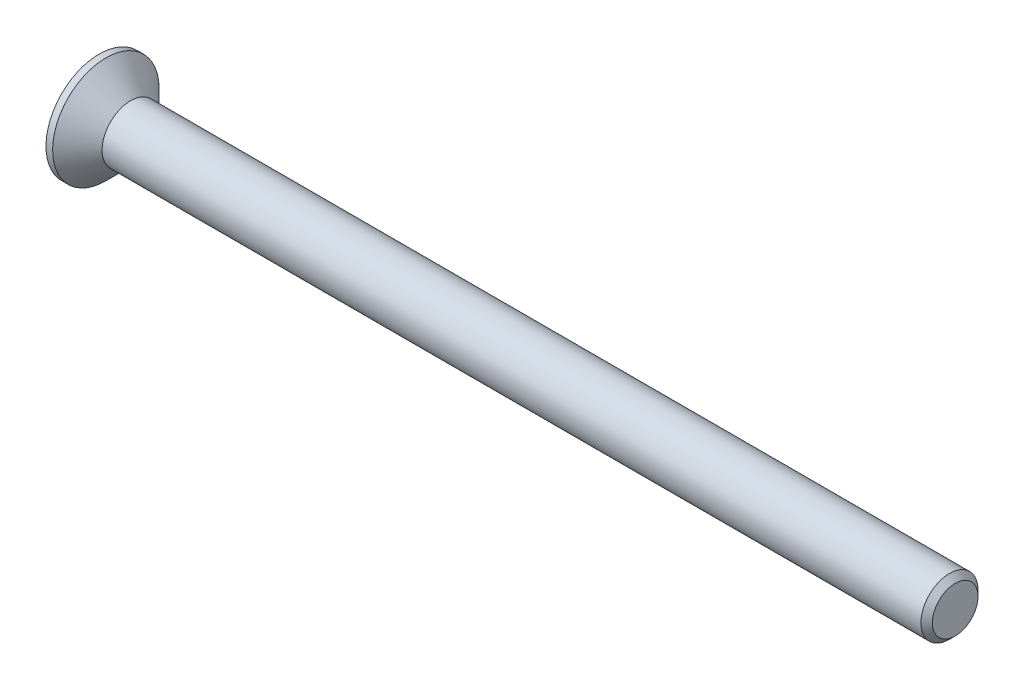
ISO-10303-21;
HEADER;
FILE_DESCRIPTION(('STEP AP214'),'2;1');
FILE_NAME('part.step','',(''),(''),'','','');
FILE_SCHEMA(('AUTOMOTIVE_DESIGN { 1 0 10303 214 1 1 1 1 }'));
ENDSEC;
DATA;
#1=APPLICATION_CONTEXT('core data for automotive mechanical design processes');
#2=APPLICATION_PROTOCOL_DEFINITION('international standard','automotive_design',2000,#1);
#3=PRODUCT_CONTEXT('',#1,'mechanical');
#4=PRODUCT('Part','Part','',(#3));
#5=PRODUCT_RELATED_PRODUCT_CATEGORY('part','',(#4));
#6=PRODUCT_DEFINITION_FORMATION('','',#4);
#7=PRODUCT_DEFINITION_CONTEXT('part definition',#1,'design');
#8=PRODUCT_DEFINITION('design','',#6,#7);
#9=PRODUCT_DEFINITION_SHAPE('','',#8);
#10=(LENGTH_UNIT() NAMED_UNIT(*) SI_UNIT(.MILLI.,.METRE.));
#11=(NAMED_UNIT(*) PLANE_ANGLE_UNIT() SI_UNIT($,.RADIAN.));
#12=(NAMED_UNIT(*) SI_UNIT($,.STERADIAN.) SOLID_ANGLE_UNIT());
#13=UNCERTAINTY_MEASURE_WITH_UNIT(LENGTH_MEASURE(1.E-05),#10,'distance_accuracy_value','');
#14=(GEOMETRIC_REPRESENTATION_CONTEXT(3) GLOBAL_UNCERTAINTY_ASSIGNED_CONTEXT((#13)) GLOBAL_UNIT_ASSIGNED_CONTEXT((#10,
#11,#12)) REPRESENTATION_CONTEXT('',''));
#15=CARTESIAN_POINT('',(0.,0.,0.));
#16=DIRECTION('',(0.,0.,1.));
#17=DIRECTION('',(1.,0.,0.));
#18=AXIS2_PLACEMENT_3D('',#15,#16,#17);
#19=CARTESIAN_POINT('',(0.,0.,0.));
#20=DIRECTION('',(-1.,0.,0.));
#21=DIRECTION('',(0.,-1.,0.));
#22=AXIS2_PLACEMENT_3D('',#19,#20,#21);
#23=CONICAL_SURFACE('',#22,1.5,0.78539816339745);
#24=CARTESIAN_POINT('',(-1.3,0.,0.));
#25=DIRECTION('',(-1.,0.,0.));
#26=DIRECTION('',(0.,-1.,0.));
#27=AXIS2_PLACEMENT_3D('',#24,#25,#26);
#28=CIRCLE('',#27,2.8);
#29=CARTESIAN_POINT('',(-1.3,-2.8,0.));
#30=VERTEX_POINT('',#29);
#31=EDGE_CURVE('E189',#30,#30,#28,.T.);
#32=ORIENTED_EDGE('',*,*,#31,.F.);
#33=EDGE_LOOP('',(#32));
#34=FACE_BOUND('',#33,.T.);
#35=CARTESIAN_POINT('',(0.,0.,0.));
#36=DIRECTION('',(-1.,0.,0.));
#37=DIRECTION('',(0.,-1.,0.));
#38=AXIS2_PLACEMENT_3D('',#35,#36,#37);
#39=CIRCLE('',#38,1.5);
#40=CARTESIAN_POINT('',(0.,-1.5,0.));
#41=VERTEX_POINT('',#40);
#42=EDGE_CURVE('E212',#41,#41,#39,.T.);
#43=ORIENTED_EDGE('',*,*,#42,.T.);
#44=EDGE_LOOP('',(#43));
#45=FACE_BOUND('',#44,.T.);
#46=ADVANCED_FACE('F33',(#34,#45),#23,.T.);
#47=CARTESIAN_POINT('',(-1.65,0.,0.));
#48=DIRECTION('',(-1.,0.,0.));
#49=DIRECTION('',(0.,-1.,0.));
#50=AXIS2_PLACEMENT_3D('',#47,#48,#49);
#51=CYLINDRICAL_SURFACE('',#50,1.5);
#52=CARTESIAN_POINT('',(43.05,0.,0.));
#53=DIRECTION('',(-1.,0.,0.));
#54=DIRECTION('',(0.,-1.,0.));
#55=AXIS2_PLACEMENT_3D('',#52,#53,#54);
#56=CIRCLE('',#55,1.5);
#57=CARTESIAN_POINT('',(43.05,-1.5,0.));
#58=VERTEX_POINT('',#57);
#59=EDGE_CURVE('E41',#58,#58,#56,.T.);
#60=ORIENTED_EDGE('',*,*,#59,.T.);
#61=EDGE_LOOP('',(#60));
#62=FACE_BOUND('',#61,.T.);
#63=ORIENTED_EDGE('',*,*,#42,.F.);
#64=EDGE_LOOP('',(#63));
#65=FACE_BOUND('',#64,.T.);
#66=ADVANCED_FACE('F217',(#62,#65),#51,.T.);
#67=CARTESIAN_POINT('',(43.35,0.,0.));
#68=DIRECTION('',(-1.,0.,0.));
#69=DIRECTION('',(0.,-1.,0.));
#70=AXIS2_PLACEMENT_3D('',#67,#68,#69);
#71=PLANE('',#70);
#72=CARTESIAN_POINT('',(43.35,0.,0.));
#73=DIRECTION('',(-1.,0.,0.));
#74=DIRECTION('',(0.,-1.,0.));
#75=AXIS2_PLACEMENT_3D('',#72,#73,#74);
#76=CIRCLE('',#75,1.19999999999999);
#77=CARTESIAN_POINT('',(43.35,-1.19999999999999,0.));
#78=VERTEX_POINT('',#77);
#79=EDGE_CURVE('E11',#78,#78,#76,.F.);
#80=ORIENTED_EDGE('',*,*,#79,.T.);
#81=EDGE_LOOP('',(#80));
#82=FACE_BOUND('',#81,.T.);
#83=ADVANCED_FACE('F239',(#82),#71,.F.);
#84=CARTESIAN_POINT('',(-1.65,2.8,0.));
#85=DIRECTION('',(1.,0.,0.));
#86=DIRECTION('',(0.,1.,0.));
#87=AXIS2_PLACEMENT_3D('',#84,#85,#86);
#88=PLANE('',#87);
#89=DIRECTION('',(0.,0.,-1.));
#90=VECTOR('',#89,1.);
#91=CARTESIAN_POINT('',(-1.65,0.365,-1.45));
#92=LINE('',#91,#90);
#93=CARTESIAN_POINT('',(-1.65,0.365,-0.365));
#94=VERTEX_POINT('',#93);
#95=CARTESIAN_POINT('',(-1.65,0.365,-1.45));
#96=VERTEX_POINT('',#95);
#97=EDGE_CURVE('E158',#94,#96,#92,.T.);
#98=ORIENTED_EDGE('',*,*,#97,.F.);
#99=DIRECTION('',(0.,-1.,0.));
#100=VECTOR('',#99,1.);
#101=CARTESIAN_POINT('',(-1.65,0.365,-0.365));
#102=LINE('',#101,#100);
#103=CARTESIAN_POINT('',(-1.65,1.45,-0.365));
#104=VERTEX_POINT('',#103);
#105=EDGE_CURVE('E48',#104,#94,#102,.T.);
#106=ORIENTED_EDGE('',*,*,#105,.F.);
#107=DIRECTION('',(0.,0.,-1.));
#108=VECTOR('',#107,1.);
#109=CARTESIAN_POINT('',(-1.65,1.45,-0.365));
#110=LINE('',#109,#108);
#111=CARTESIAN_POINT('',(-1.65,1.45,0.365));
#112=VERTEX_POINT('',#111);
#113=EDGE_CURVE('E185',#112,#104,#110,.T.);
#114=ORIENTED_EDGE('',*,*,#113,.F.);
#115=DIRECTION('',(0.,1.,0.));
#116=VECTOR('',#115,1.);
#117=CARTESIAN_POINT('',(-1.65,1.45,0.365));
#118=LINE('',#117,#116);
#119=CARTESIAN_POINT('',(-1.65,0.365,0.365));
#120=VERTEX_POINT('',#119);
#121=EDGE_CURVE('E183',#120,#112,#118,.T.);
#122=ORIENTED_EDGE('',*,*,#121,.F.);
#123=DIRECTION('',(0.,0.,-1.));
#124=VECTOR('',#123,1.);
#125=CARTESIAN_POINT('',(-1.65,0.365,0.365));
#126=LINE('',#125,#124);
#127=CARTESIAN_POINT('',(-1.65,0.365,1.45));
#128=VERTEX_POINT('',#127);
#129=EDGE_CURVE('E132',#128,#120,#126,.T.);
#130=ORIENTED_EDGE('',*,*,#129,.F.);
#131=DIRECTION('',(0.,1.,0.));
#132=VECTOR('',#131,1.);
#133=CARTESIAN_POINT('',(-1.65,0.365,1.45));
#134=LINE('',#133,#132);
#135=CARTESIAN_POINT('',(-1.65,-0.365,1.45));
#136=VERTEX_POINT('',#135);
#137=EDGE_CURVE('E179',#136,#128,#134,.T.);
#138=ORIENTED_EDGE('',*,*,#137,.F.);
#139=DIRECTION('',(0.,0.,1.));
#140=VECTOR('',#139,1.);
#141=CARTESIAN_POINT('',(-1.65,-0.365,1.45));
#142=LINE('',#141,#140);
#143=CARTESIAN_POINT('',(-1.65,-0.365,0.365));
#144=VERTEX_POINT('',#143);
#145=EDGE_CURVE('E176',#144,#136,#142,.T.);
#146=ORIENTED_EDGE('',*,*,#145,.F.);
#147=DIRECTION('',(0.,1.,0.));
#148=VECTOR('',#147,1.);
#149=CARTESIAN_POINT('',(-1.65,-0.365,0.365));
#150=LINE('',#149,#148);
#151=CARTESIAN_POINT('',(-1.65,-1.45,0.365));
#152=VERTEX_POINT('',#151);
#153=EDGE_CURVE('E173',#152,#144,#150,.T.);
#154=ORIENTED_EDGE('',*,*,#153,.F.);
#155=DIRECTION('',(0.,0.,1.));
#156=VECTOR('',#155,1.);
#157=CARTESIAN_POINT('',(-1.65,-1.45,0.365));
#158=LINE('',#157,#156);
#159=CARTESIAN_POINT('',(-1.65,-1.45,-0.365));
#160=VERTEX_POINT('',#159);
#161=EDGE_CURVE('E170',#160,#152,#158,.T.);
#162=ORIENTED_EDGE('',*,*,#161,.F.);
#163=DIRECTION('',(0.,-1.,0.));
#164=VECTOR('',#163,1.);
#165=CARTESIAN_POINT('',(-1.65,-1.45,-0.365));
#166=LINE('',#165,#164);
#167=CARTESIAN_POINT('',(-1.65,-0.365,-0.365));
#168=VERTEX_POINT('',#167);
#169=EDGE_CURVE('E167',#168,#160,#166,.T.);
#170=ORIENTED_EDGE('',*,*,#169,.F.);
#171=DIRECTION('',(0.,0.,1.));
#172=VECTOR('',#171,1.);
#173=CARTESIAN_POINT('',(-1.65,-0.365,-0.365));
#174=LINE('',#173,#172);
#175=CARTESIAN_POINT('',(-1.65,-0.365,-1.45));
#176=VERTEX_POINT('',#175);
#177=EDGE_CURVE('E164',#176,#168,#174,.T.);
#178=ORIENTED_EDGE('',*,*,#177,.F.);
#179=DIRECTION('',(0.,-1.,0.));
#180=VECTOR('',#179,1.);
#181=CARTESIAN_POINT('',(-1.65,-0.365,-1.45));
#182=LINE('',#181,#180);
#183=EDGE_CURVE('E161',#96,#176,#182,.T.);
#184=ORIENTED_EDGE('',*,*,#183,.F.);
#185=EDGE_LOOP('',(#98,#106,#114,#122,#130,#138,#146,#154,#162,#170,#178,#184));
#186=FACE_BOUND('',#185,.T.);
#187=CARTESIAN_POINT('',(-1.65,0.,0.));
#188=DIRECTION('',(-1.,0.,0.));
#189=DIRECTION('',(0.,-1.,0.));
#190=AXIS2_PLACEMENT_3D('',#187,#188,#189);
#191=CIRCLE('',#190,2.8);
#192=CARTESIAN_POINT('',(-1.65,-2.8,0.));
#193=VERTEX_POINT('',#192);
#194=EDGE_CURVE('E209',#193,#193,#191,.T.);
#195=ORIENTED_EDGE('',*,*,#194,.T.);
#196=EDGE_LOOP('',(#195));
#197=FACE_BOUND('',#196,.T.);
#198=ADVANCED_FACE('F230',(#186,#197),#88,.F.);
#199=CARTESIAN_POINT('',(-1.65,0.,0.));
#200=DIRECTION('',(-1.,0.,0.));
#201=DIRECTION('',(0.,-1.,0.));
#202=AXIS2_PLACEMENT_3D('',#199,#200,#201);
#203=CYLINDRICAL_SURFACE('',#202,2.8);
#204=ORIENTED_EDGE('',*,*,#194,.F.);
#205=EDGE_LOOP('',(#204));
#206=FACE_BOUND('',#205,.T.);
#207=ORIENTED_EDGE('',*,*,#31,.T.);
#208=EDGE_LOOP('',(#207));
#209=FACE_BOUND('',#208,.T.);
#210=ADVANCED_FACE('F222',(#206,#209),#203,.T.);
#211=CARTESIAN_POINT('',(43.05,0.,0.));
#212=DIRECTION('',(-1.,0.,0.));
#213=DIRECTION('',(0.,-1.,0.));
#214=AXIS2_PLACEMENT_3D('',#211,#212,#213);
#215=CONICAL_SURFACE('',#214,1.5,0.78539816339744);
#216=ORIENTED_EDGE('',*,*,#79,.F.);
#217=EDGE_LOOP('',(#216));
#218=FACE_BOUND('',#217,.T.);
#219=ORIENTED_EDGE('',*,*,#59,.F.);
#220=EDGE_LOOP('',(#219));
#221=FACE_BOUND('',#220,.T.);
#222=ADVANCED_FACE('F35',(#218,#221),#215,.T.);
#223=CARTESIAN_POINT('',(-0.4,0.365,-0.365));
#224=DIRECTION('',(0.,0.,-1.));
#225=DIRECTION('',(-1.,0.,0.));
#226=AXIS2_PLACEMENT_3D('',#223,#224,#225);
#227=PLANE('',#226);
#228=ORIENTED_EDGE('',*,*,#105,.T.);
#229=DIRECTION('',(-1.,0.,0.));
#230=VECTOR('',#229,1.);
#231=CARTESIAN_POINT('',(-0.4,0.365,-0.365));
#232=LINE('',#231,#230);
#233=CARTESIAN_POINT('',(-0.4,0.365,-0.365));
#234=VERTEX_POINT('',#233);
#235=EDGE_CURVE('E96',#234,#94,#232,.T.);
#236=ORIENTED_EDGE('',*,*,#235,.F.);
#237=DIRECTION('',(0.,-1.,0.));
#238=VECTOR('',#237,1.);
#239=CARTESIAN_POINT('',(-0.4,0.365,-0.365));
#240=LINE('',#239,#238);
#241=CARTESIAN_POINT('',(-0.4,1.45,-0.365));
#242=VERTEX_POINT('',#241);
#243=EDGE_CURVE('E187',#242,#234,#240,.T.);
#244=ORIENTED_EDGE('',*,*,#243,.F.);
#245=DIRECTION('',(-1.,0.,0.));
#246=VECTOR('',#245,1.);
#247=CARTESIAN_POINT('',(-0.4,1.45,-0.365));
#248=LINE('',#247,#246);
#249=EDGE_CURVE('E56',#242,#104,#248,.T.);
#250=ORIENTED_EDGE('',*,*,#249,.T.);
#251=EDGE_LOOP('',(#228,#236,#244,#250));
#252=FACE_BOUND('',#251,.T.);
#253=ADVANCED_FACE('F221',(#252),#227,.F.);
#254=CARTESIAN_POINT('',(-0.4,1.45,-0.365));
#255=DIRECTION('',(0.,1.,0.));
#256=DIRECTION('',(-1.,0.,0.));
#257=AXIS2_PLACEMENT_3D('',#254,#255,#256);
#258=PLANE('',#257);
#259=ORIENTED_EDGE('',*,*,#113,.T.);
#260=ORIENTED_EDGE('',*,*,#249,.F.);
#261=DIRECTION('',(0.,0.,-1.));
#262=VECTOR('',#261,1.);
#263=CARTESIAN_POINT('',(-0.4,1.45,-0.365));
#264=LINE('',#263,#262);
#265=CARTESIAN_POINT('',(-0.4,1.45,0.365));
#266=VERTEX_POINT('',#265);
#267=EDGE_CURVE('E144',#266,#242,#264,.T.);
#268=ORIENTED_EDGE('',*,*,#267,.F.);
#269=DIRECTION('',(-1.,0.,0.));
#270=VECTOR('',#269,1.);
#271=CARTESIAN_POINT('',(-0.4,1.45,0.365));
#272=LINE('',#271,#270);
#273=EDGE_CURVE('E136',#266,#112,#272,.T.);
#274=ORIENTED_EDGE('',*,*,#273,.T.);
#275=EDGE_LOOP('',(#259,#260,#268,#274));
#276=FACE_BOUND('',#275,.T.);
#277=ADVANCED_FACE('F228',(#276),#258,.F.);
#278=CARTESIAN_POINT('',(-0.4,1.45,0.365));
#279=DIRECTION('',(0.,0.,1.));
#280=DIRECTION('',(1.,0.,0.));
#281=AXIS2_PLACEMENT_3D('',#278,#279,#280);
#282=PLANE('',#281);
#283=ORIENTED_EDGE('',*,*,#121,.T.);
#284=ORIENTED_EDGE('',*,*,#273,.F.);
#285=DIRECTION('',(0.,1.,0.));
#286=VECTOR('',#285,1.);
#287=CARTESIAN_POINT('',(-0.4,1.45,0.365));
#288=LINE('',#287,#286);
#289=CARTESIAN_POINT('',(-0.4,0.365,0.365));
#290=VERTEX_POINT('',#289);
#291=EDGE_CURVE('E140',#290,#266,#288,.T.);
#292=ORIENTED_EDGE('',*,*,#291,.F.);
#293=DIRECTION('',(-1.,0.,0.));
#294=VECTOR('',#293,1.);
#295=CARTESIAN_POINT('',(-0.4,0.365,0.365));
#296=LINE('',#295,#294);
#297=EDGE_CURVE('E125',#290,#120,#296,.T.);
#298=ORIENTED_EDGE('',*,*,#297,.T.);
#299=EDGE_LOOP('',(#283,#284,#292,#298));
#300=FACE_BOUND('',#299,.T.);
#301=ADVANCED_FACE('F141',(#300),#282,.F.);
#302=CARTESIAN_POINT('',(-0.4,0.365,0.365));
#303=DIRECTION('',(0.,1.,0.));
#304=DIRECTION('',(-1.,0.,0.));
#305=AXIS2_PLACEMENT_3D('',#302,#303,#304);
#306=PLANE('',#305);
#307=ORIENTED_EDGE('',*,*,#129,.T.);
#308=ORIENTED_EDGE('',*,*,#297,.F.);
#309=DIRECTION('',(0.,0.,-1.));
#310=VECTOR('',#309,1.);
#311=CARTESIAN_POINT('',(-0.4,0.365,0.365));
#312=LINE('',#311,#310);
#313=CARTESIAN_POINT('',(-0.4,0.365,1.45));
#314=VERTEX_POINT('',#313);
#315=EDGE_CURVE('E129',#314,#290,#312,.T.);
#316=ORIENTED_EDGE('',*,*,#315,.F.);
#317=DIRECTION('',(-1.,0.,0.));
#318=VECTOR('',#317,1.);
#319=CARTESIAN_POINT('',(-0.4,0.365,1.45));
#320=LINE('',#319,#318);
#321=EDGE_CURVE('E137',#314,#128,#320,.T.);
#322=ORIENTED_EDGE('',*,*,#321,.T.);
#323=EDGE_LOOP('',(#307,#308,#316,#322));
#324=FACE_BOUND('',#323,.T.);
#325=ADVANCED_FACE('F127',(#324),#306,.F.);
#326=CARTESIAN_POINT('',(-0.4,0.365,1.45));
#327=DIRECTION('',(0.,0.,1.));
#328=DIRECTION('',(1.,0.,0.));
#329=AXIS2_PLACEMENT_3D('',#326,#327,#328);
#330=PLANE('',#329);
#331=ORIENTED_EDGE('',*,*,#137,.T.);
#332=ORIENTED_EDGE('',*,*,#321,.F.);
#333=DIRECTION('',(0.,1.,0.));
#334=VECTOR('',#333,1.);
#335=CARTESIAN_POINT('',(-0.4,0.365,1.45));
#336=LINE('',#335,#334);
#337=CARTESIAN_POINT('',(-0.4,-0.365,1.45));
#338=VERTEX_POINT('',#337);
#339=EDGE_CURVE('E150',#338,#314,#336,.T.);
#340=ORIENTED_EDGE('',*,*,#339,.F.);
#341=DIRECTION('',(-1.,0.,0.));
#342=VECTOR('',#341,1.);
#343=CARTESIAN_POINT('',(-0.4,-0.365,1.45));
#344=LINE('',#343,#342);
#345=EDGE_CURVE('E192',#338,#136,#344,.T.);
#346=ORIENTED_EDGE('',*,*,#345,.T.);
#347=EDGE_LOOP('',(#331,#332,#340,#346));
#348=FACE_BOUND('',#347,.T.);
#349=ADVANCED_FACE('F277',(#348),#330,.F.);
#350=CARTESIAN_POINT('',(-0.4,-0.365,1.45));
#351=DIRECTION('',(0.,-1.,0.));
#352=DIRECTION('',(1.,0.,0.));
#353=AXIS2_PLACEMENT_3D('',#350,#351,#352);
#354=PLANE('',#353);
#355=ORIENTED_EDGE('',*,*,#145,.T.);
#356=ORIENTED_EDGE('',*,*,#345,.F.);
#357=DIRECTION('',(0.,0.,1.));
#358=VECTOR('',#357,1.);
#359=CARTESIAN_POINT('',(-0.4,-0.365,1.45));
#360=LINE('',#359,#358);
#361=CARTESIAN_POINT('',(-0.4,-0.365,0.365));
#362=VERTEX_POINT('',#361);
#363=EDGE_CURVE('E152',#362,#338,#360,.T.);
#364=ORIENTED_EDGE('',*,*,#363,.F.);
#365=DIRECTION('',(-1.,0.,0.));
#366=VECTOR('',#365,1.);
#367=CARTESIAN_POINT('',(-0.4,-0.365,0.365));
#368=LINE('',#367,#366);
#369=EDGE_CURVE('E194',#362,#144,#368,.T.);
#370=ORIENTED_EDGE('',*,*,#369,.T.);
#371=EDGE_LOOP('',(#355,#356,#364,#370));
#372=FACE_BOUND('',#371,.T.);
#373=ADVANCED_FACE('F273',(#372),#354,.F.);
#374=CARTESIAN_POINT('',(-0.4,-0.365,0.365));
#375=DIRECTION('',(0.,0.,1.));
#376=DIRECTION('',(1.,0.,0.));
#377=AXIS2_PLACEMENT_3D('',#374,#375,#376);
#378=PLANE('',#377);
#379=ORIENTED_EDGE('',*,*,#153,.T.);
#380=ORIENTED_EDGE('',*,*,#369,.F.);
#381=DIRECTION('',(0.,1.,0.));
#382=VECTOR('',#381,1.);
#383=CARTESIAN_POINT('',(-0.4,-0.365,0.365));
#384=LINE('',#383,#382);
#385=CARTESIAN_POINT('',(-0.4,-1.45,0.365));
#386=VERTEX_POINT('',#385);
#387=EDGE_CURVE('E422',#386,#362,#384,.T.);
#388=ORIENTED_EDGE('',*,*,#387,.F.);
#389=DIRECTION('',(-1.,0.,0.));
#390=VECTOR('',#389,1.);
#391=CARTESIAN_POINT('',(-0.4,-1.45,0.365));
#392=LINE('',#391,#390);
#393=EDGE_CURVE('E196',#386,#152,#392,.T.);
#394=ORIENTED_EDGE('',*,*,#393,.T.);
#395=EDGE_LOOP('',(#379,#380,#388,#394));
#396=FACE_BOUND('',#395,.T.);
#397=ADVANCED_FACE('F269',(#396),#378,.F.);
#398=CARTESIAN_POINT('',(-0.4,-1.45,0.365));
#399=DIRECTION('',(0.,-1.,0.));
#400=DIRECTION('',(1.,0.,0.));
#401=AXIS2_PLACEMENT_3D('',#398,#399,#400);
#402=PLANE('',#401);
#403=ORIENTED_EDGE('',*,*,#161,.T.);
#404=ORIENTED_EDGE('',*,*,#393,.F.);
#405=DIRECTION('',(0.,0.,1.));
#406=VECTOR('',#405,1.);
#407=CARTESIAN_POINT('',(-0.4,-1.45,0.365));
#408=LINE('',#407,#406);
#409=CARTESIAN_POINT('',(-0.4,-1.45,-0.365));
#410=VERTEX_POINT('',#409);
#411=EDGE_CURVE('E419',#410,#386,#408,.T.);
#412=ORIENTED_EDGE('',*,*,#411,.F.);
#413=DIRECTION('',(-1.,0.,0.));
#414=VECTOR('',#413,1.);
#415=CARTESIAN_POINT('',(-0.4,-1.45,-0.365));
#416=LINE('',#415,#414);
#417=EDGE_CURVE('E198',#410,#160,#416,.T.);
#418=ORIENTED_EDGE('',*,*,#417,.T.);
#419=EDGE_LOOP('',(#403,#404,#412,#418));
#420=FACE_BOUND('',#419,.T.);
#421=ADVANCED_FACE('F265',(#420),#402,.F.);
#422=CARTESIAN_POINT('',(-0.4,-1.45,-0.365));
#423=DIRECTION('',(0.,0.,-1.));
#424=DIRECTION('',(-1.,0.,0.));
#425=AXIS2_PLACEMENT_3D('',#422,#423,#424);
#426=PLANE('',#425);
#427=ORIENTED_EDGE('',*,*,#169,.T.);
#428=ORIENTED_EDGE('',*,*,#417,.F.);
#429=DIRECTION('',(0.,-1.,0.));
#430=VECTOR('',#429,1.);
#431=CARTESIAN_POINT('',(-0.4,-1.45,-0.365));
#432=LINE('',#431,#430);
#433=CARTESIAN_POINT('',(-0.4,-0.365,-0.365));
#434=VERTEX_POINT('',#433);
#435=EDGE_CURVE('E416',#434,#410,#432,.T.);
#436=ORIENTED_EDGE('',*,*,#435,.F.);
#437=DIRECTION('',(-1.,0.,0.));
#438=VECTOR('',#437,1.);
#439=CARTESIAN_POINT('',(-0.4,-0.365,-0.365));
#440=LINE('',#439,#438);
#441=EDGE_CURVE('E200',#434,#168,#440,.T.);
#442=ORIENTED_EDGE('',*,*,#441,.T.);
#443=EDGE_LOOP('',(#427,#428,#436,#442));
#444=FACE_BOUND('',#443,.T.);
#445=ADVANCED_FACE('F261',(#444),#426,.F.);
#446=CARTESIAN_POINT('',(-0.4,-0.365,-0.365));
#447=DIRECTION('',(0.,-1.,0.));
#448=DIRECTION('',(1.,0.,0.));
#449=AXIS2_PLACEMENT_3D('',#446,#447,#448);
#450=PLANE('',#449);
#451=ORIENTED_EDGE('',*,*,#177,.T.);
#452=ORIENTED_EDGE('',*,*,#441,.F.);
#453=DIRECTION('',(0.,0.,1.));
#454=VECTOR('',#453,1.);
#455=CARTESIAN_POINT('',(-0.4,-0.365,-0.365));
#456=LINE('',#455,#454);
#457=CARTESIAN_POINT('',(-0.4,-0.365,-1.45));
#458=VERTEX_POINT('',#457);
#459=EDGE_CURVE('E413',#458,#434,#456,.T.);
#460=ORIENTED_EDGE('',*,*,#459,.F.);
#461=DIRECTION('',(-1.,0.,0.));
#462=VECTOR('',#461,1.);
#463=CARTESIAN_POINT('',(-0.4,-0.365,-1.45));
#464=LINE('',#463,#462);
#465=EDGE_CURVE('E202',#458,#176,#464,.T.);
#466=ORIENTED_EDGE('',*,*,#465,.T.);
#467=EDGE_LOOP('',(#451,#452,#460,#466));
#468=FACE_BOUND('',#467,.T.);
#469=ADVANCED_FACE('F257',(#468),#450,.F.);
#470=CARTESIAN_POINT('',(-0.4,-0.365,-1.45));
#471=DIRECTION('',(0.,0.,-1.));
#472=DIRECTION('',(-1.,0.,0.));
#473=AXIS2_PLACEMENT_3D('',#470,#471,#472);
#474=PLANE('',#473);
#475=ORIENTED_EDGE('',*,*,#183,.T.);
#476=ORIENTED_EDGE('',*,*,#465,.F.);
#477=DIRECTION('',(0.,-1.,0.));
#478=VECTOR('',#477,1.);
#479=CARTESIAN_POINT('',(-0.4,-0.365,-1.45));
#480=LINE('',#479,#478);
#481=CARTESIAN_POINT('',(-0.4,0.365,-1.45));
#482=VERTEX_POINT('',#481);
#483=EDGE_CURVE('E408',#482,#458,#480,.T.);
#484=ORIENTED_EDGE('',*,*,#483,.F.);
#485=DIRECTION('',(-1.,0.,0.));
#486=VECTOR('',#485,1.);
#487=CARTESIAN_POINT('',(-0.4,0.365,-1.45));
#488=LINE('',#487,#486);
#489=EDGE_CURVE('E204',#482,#96,#488,.T.);
#490=ORIENTED_EDGE('',*,*,#489,.T.);
#491=EDGE_LOOP('',(#475,#476,#484,#490));
#492=FACE_BOUND('',#491,.T.);
#493=ADVANCED_FACE('F253',(#492),#474,.F.);
#494=CARTESIAN_POINT('',(-0.4,0.365,-1.45));
#495=DIRECTION('',(0.,1.,0.));
#496=DIRECTION('',(-1.,0.,0.));
#497=AXIS2_PLACEMENT_3D('',#494,#495,#496);
#498=PLANE('',#497);
#499=ORIENTED_EDGE('',*,*,#97,.T.);
#500=ORIENTED_EDGE('',*,*,#489,.F.);
#501=DIRECTION('',(0.,0.,-1.));
#502=VECTOR('',#501,1.);
#503=CARTESIAN_POINT('',(-0.4,0.365,-1.45));
#504=LINE('',#503,#502);
#505=EDGE_CURVE('E406',#234,#482,#504,.T.);
#506=ORIENTED_EDGE('',*,*,#505,.F.);
#507=ORIENTED_EDGE('',*,*,#235,.T.);
#508=EDGE_LOOP('',(#499,#500,#506,#507));
#509=FACE_BOUND('',#508,.T.);
#510=ADVANCED_FACE('F250',(#509),#498,.F.);
#511=CARTESIAN_POINT('',(-0.4,0.,0.));
#512=DIRECTION('',(1.,0.,0.));
#513=DIRECTION('',(0.,0.,-1.));
#514=AXIS2_PLACEMENT_3D('',#511,#512,#513);
#515=PLANE('',#514);
#516=ORIENTED_EDGE('',*,*,#243,.T.);
#517=ORIENTED_EDGE('',*,*,#505,.T.);
#518=ORIENTED_EDGE('',*,*,#483,.T.);
#519=ORIENTED_EDGE('',*,*,#459,.T.);
#520=ORIENTED_EDGE('',*,*,#435,.T.);
#521=ORIENTED_EDGE('',*,*,#411,.T.);
#522=ORIENTED_EDGE('',*,*,#387,.T.);
#523=ORIENTED_EDGE('',*,*,#363,.T.);
#524=ORIENTED_EDGE('',*,*,#339,.T.);
#525=ORIENTED_EDGE('',*,*,#315,.T.);
#526=ORIENTED_EDGE('',*,*,#291,.T.);
#527=ORIENTED_EDGE('',*,*,#267,.T.);
#528=EDGE_LOOP('',(#516,#517,#518,#519,#520,#521,#522,#523,#524,#525,#526,#527));
#529=FACE_BOUND('',#528,.T.);
#530=ADVANCED_FACE('F147',(#529),#515,.F.);
#531=CLOSED_SHELL('',(#46,#66,#83,#198,#210,#222,#253,#277,#301,#325,#349,#373,#397,#421,#445,
#469,#493,#510,#530));
#532=MANIFOLD_SOLID_BREP('B2',#531);
#533=ADVANCED_BREP_SHAPE_REPRESENTATION('',(#18,#532),#14);
#534=SHAPE_DEFINITION_REPRESENTATION(#9,#533);
ENDSEC;
END-ISO-10303-21;
